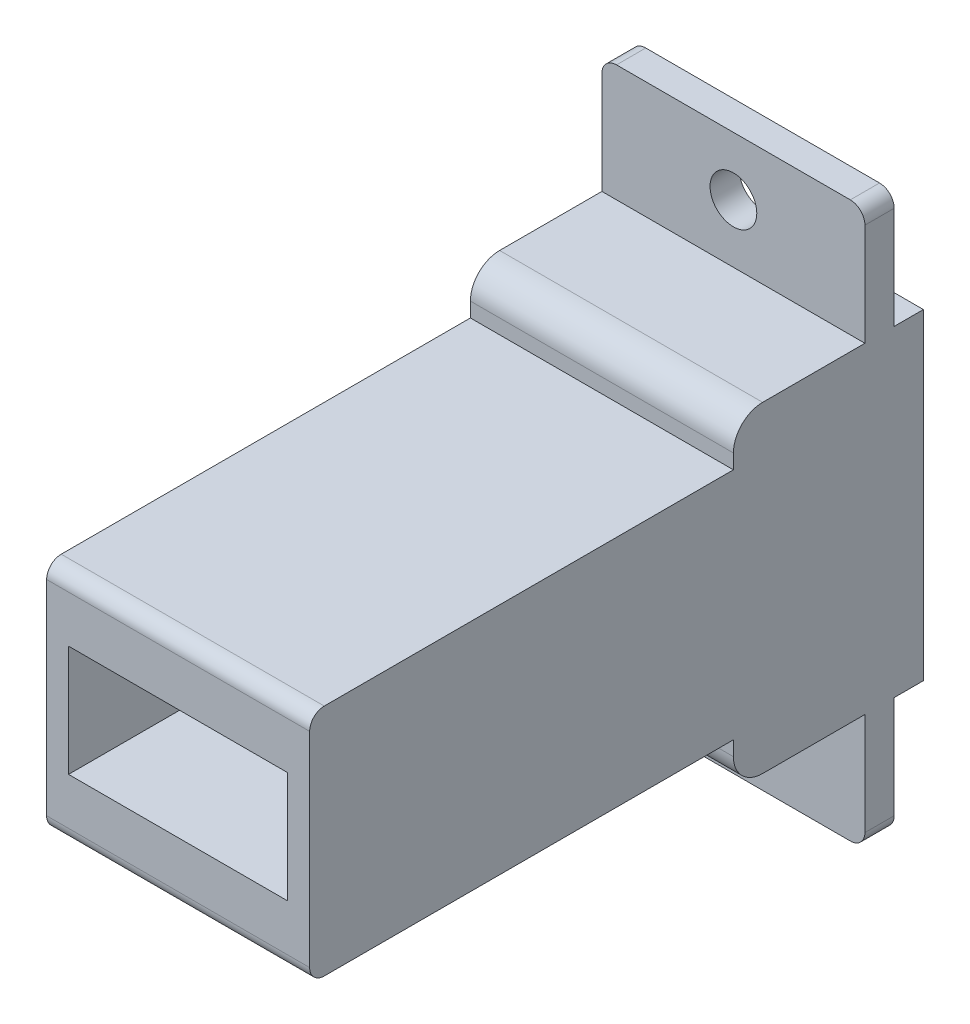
from build123d import *

# Parameters (mm, degrees)
SKETCH1_W           = 18
SKETCH1_H           = 38
SKETCH1_R           = 1.6
BOSS_EXTRUDE1_DEPTH = 2
FILLET1_R           = 1
BOSS_EXTRUDE2_DEPTH = 9
SKETCH3_W           = 15
SKETCH3_H           = 7.6
CUT_EXTRUDE1_DEPTH  = 15
SKETCH4_W           = 2
SKETCH4_H           = 22
BOSS_EXTRUDE3_DEPTH = 9


with BuildPart() as part:
    # Sketch1 → Boss-Extrude1 (new body)
    with BuildSketch(Plane.XY):
        Rectangle(SKETCH1_W, SKETCH1_H)
        with Locations((0, 15)):
            Circle(SKETCH1_R, mode=Mode.SUBTRACT)
        with Locations((0, -15)):
            Circle(SKETCH1_R, mode=Mode.SUBTRACT)
    extrude(amount=BOSS_EXTRUDE1_DEPTH)

    # Fillet1
    fillet1_edges = [part.edges().sort_by_distance(p)[0] for p in [
        (9, -19, 1),
        (-9, -19, 1),
        (-9, 19, 1),
        (9, 19, 1),
    ]]
    fillet(fillet1_edges, radius=FILLET1_R)

    # Sketch2 → Boss-Extrude2 (add, symmetric)
    with BuildSketch(Plane(origin=(0, 0, 0), x_dir=(0, 0, -1), z_dir=(1, 0, 0))):
        with BuildLine():
            Line((-2, 11), (-9, 11))
            ThreePointArc((-9, 11), (-10.414213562, 10.414213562), (-11, 9))
            Line((-11, 9), (-11, 8))
            Line((-11, 8), (-39, 8))
            ThreePointArc((-39, 8), (-39.707106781, 7.707106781), (-40, 7))
            Line((-40, 7), (-40, -7))
            ThreePointArc((-40, -7), (-39.707106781, -7.707106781), (-39, -8))
            Line((-39, -8), (-11, -8))
            Line((-11, -8), (-11, -9))
            ThreePointArc((-11, -9), (-10.414213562, -10.414213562), (-9, -11))
            Line((-9, -11), (-2, -11))
            Line((-2, -11), (-2, 11))
        make_face()
    extrude(amount=BOSS_EXTRUDE2_DEPTH, both=True)

    # Sketch3 → Cut-Extrude1 (cut)
    with BuildSketch(Plane.XY.offset(40)):
        Rectangle(SKETCH3_W, SKETCH3_H)
    extrude(amount=-CUT_EXTRUDE1_DEPTH, mode=Mode.SUBTRACT)

    # Sketch4 → Boss-Extrude3 (add, symmetric)
    with BuildSketch(Plane(origin=(0, 0, 0), x_dir=(0, 0, -1), z_dir=(1, 0, 0))):
        with Locations((1, 0)):
            Rectangle(SKETCH4_W, SKETCH4_H)
    extrude(amount=BOSS_EXTRUDE3_DEPTH, both=True)


solid = part.part
